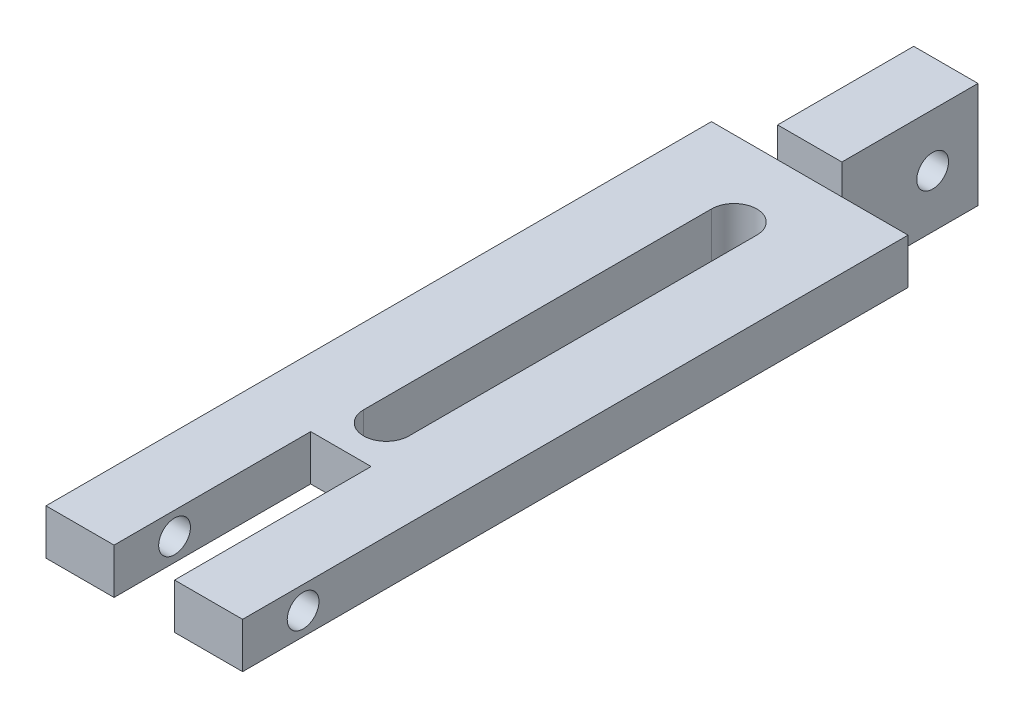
ISO-10303-21;
HEADER;
FILE_DESCRIPTION(('STEP AP214'),'2;1');
FILE_NAME('part.step','',(''),(''),'','','');
FILE_SCHEMA(('AUTOMOTIVE_DESIGN { 1 0 10303 214 1 1 1 1 }'));
ENDSEC;
DATA;
#1=APPLICATION_CONTEXT('core data for automotive mechanical design processes');
#2=APPLICATION_PROTOCOL_DEFINITION('international standard','automotive_design',2000,#1);
#3=PRODUCT_CONTEXT('',#1,'mechanical');
#4=PRODUCT('Part','Part','',(#3));
#5=PRODUCT_RELATED_PRODUCT_CATEGORY('part','',(#4));
#6=PRODUCT_DEFINITION_FORMATION('','',#4);
#7=PRODUCT_DEFINITION_CONTEXT('part definition',#1,'design');
#8=PRODUCT_DEFINITION('design','',#6,#7);
#9=PRODUCT_DEFINITION_SHAPE('','',#8);
#10=(LENGTH_UNIT() NAMED_UNIT(*) SI_UNIT(.MILLI.,.METRE.));
#11=(NAMED_UNIT(*) PLANE_ANGLE_UNIT() SI_UNIT($,.RADIAN.));
#12=(NAMED_UNIT(*) SI_UNIT($,.STERADIAN.) SOLID_ANGLE_UNIT());
#13=UNCERTAINTY_MEASURE_WITH_UNIT(LENGTH_MEASURE(1.E-05),#10,'distance_accuracy_value','');
#14=(GEOMETRIC_REPRESENTATION_CONTEXT(3) GLOBAL_UNCERTAINTY_ASSIGNED_CONTEXT((#13)) GLOBAL_UNIT_ASSIGNED_CONTEXT((#10,
#11,#12)) REPRESENTATION_CONTEXT('',''));
#15=CARTESIAN_POINT('',(0.,0.,0.));
#16=DIRECTION('',(0.,0.,1.));
#17=DIRECTION('',(1.,0.,0.));
#18=AXIS2_PLACEMENT_3D('',#15,#16,#17);
#19=CARTESIAN_POINT('',(0.,3.,0.));
#20=DIRECTION('',(0.,-1.,0.));
#21=DIRECTION('',(0.,0.,-1.));
#22=AXIS2_PLACEMENT_3D('',#19,#20,#21);
#23=PLANE('',#22);
#24=DIRECTION('',(-1.,0.,0.));
#25=VECTOR('',#24,1.);
#26=CARTESIAN_POINT('',(4.25,3.,12.));
#27=LINE('',#26,#25);
#28=CARTESIAN_POINT('',(13.,3.,12.));
#29=VERTEX_POINT('',#28);
#30=CARTESIAN_POINT('',(4.25,3.,12.));
#31=VERTEX_POINT('',#30);
#32=EDGE_CURVE('E251',#29,#31,#27,.T.);
#33=ORIENTED_EDGE('',*,*,#32,.T.);
#34=DIRECTION('',(-1.,0.,0.));
#35=VECTOR('',#34,1.);
#36=CARTESIAN_POINT('',(0.,3.,12.));
#37=LINE('',#36,#35);
#38=CARTESIAN_POINT('',(-4.25,3.,12.));
#39=VERTEX_POINT('',#38);
#40=EDGE_CURVE('E301',#31,#39,#37,.T.);
#41=ORIENTED_EDGE('',*,*,#40,.T.);
#42=DIRECTION('',(-1.,0.,0.));
#43=VECTOR('',#42,1.);
#44=CARTESIAN_POINT('',(-13.,3.,12.));
#45=LINE('',#44,#43);
#46=CARTESIAN_POINT('',(-13.,3.,12.));
#47=VERTEX_POINT('',#46);
#48=EDGE_CURVE('E246',#39,#47,#45,.T.);
#49=ORIENTED_EDGE('',*,*,#48,.T.);
#50=DIRECTION('',(0.,0.,1.));
#51=VECTOR('',#50,1.);
#52=CARTESIAN_POINT('',(-13.,3.,100.));
#53=LINE('',#52,#51);
#54=CARTESIAN_POINT('',(-13.,3.,100.));
#55=VERTEX_POINT('',#54);
#56=EDGE_CURVE('E276',#47,#55,#53,.T.);
#57=ORIENTED_EDGE('',*,*,#56,.T.);
#58=DIRECTION('',(1.,0.,0.));
#59=VECTOR('',#58,1.);
#60=CARTESIAN_POINT('',(-4.,3.,100.));
#61=LINE('',#60,#59);
#62=CARTESIAN_POINT('',(-4.,3.,100.));
#63=VERTEX_POINT('',#62);
#64=EDGE_CURVE('E279',#55,#63,#61,.T.);
#65=ORIENTED_EDGE('',*,*,#64,.T.);
#66=DIRECTION('',(0.,0.,-1.));
#67=VECTOR('',#66,1.);
#68=CARTESIAN_POINT('',(-4.,3.,74.));
#69=LINE('',#68,#67);
#70=CARTESIAN_POINT('',(-4.,3.,74.));
#71=VERTEX_POINT('',#70);
#72=EDGE_CURVE('E282',#63,#71,#69,.T.);
#73=ORIENTED_EDGE('',*,*,#72,.T.);
#74=DIRECTION('',(1.,0.,0.));
#75=VECTOR('',#74,1.);
#76=CARTESIAN_POINT('',(4.,3.,74.));
#77=LINE('',#76,#75);
#78=CARTESIAN_POINT('',(4.,3.,74.));
#79=VERTEX_POINT('',#78);
#80=EDGE_CURVE('E285',#71,#79,#77,.T.);
#81=ORIENTED_EDGE('',*,*,#80,.T.);
#82=DIRECTION('',(0.,0.,1.));
#83=VECTOR('',#82,1.);
#84=CARTESIAN_POINT('',(4.,3.,100.));
#85=LINE('',#84,#83);
#86=CARTESIAN_POINT('',(4.,3.,100.));
#87=VERTEX_POINT('',#86);
#88=EDGE_CURVE('E288',#79,#87,#85,.T.);
#89=ORIENTED_EDGE('',*,*,#88,.T.);
#90=DIRECTION('',(1.,0.,0.));
#91=VECTOR('',#90,1.);
#92=CARTESIAN_POINT('',(13.,3.,100.));
#93=LINE('',#92,#91);
#94=CARTESIAN_POINT('',(13.,3.,100.));
#95=VERTEX_POINT('',#94);
#96=EDGE_CURVE('E291',#87,#95,#93,.T.);
#97=ORIENTED_EDGE('',*,*,#96,.T.);
#98=DIRECTION('',(0.,0.,-1.));
#99=VECTOR('',#98,1.);
#100=CARTESIAN_POINT('',(13.,3.,12.));
#101=LINE('',#100,#99);
#102=EDGE_CURVE('E294',#95,#29,#101,.T.);
#103=ORIENTED_EDGE('',*,*,#102,.T.);
#104=EDGE_LOOP('',(#33,#41,#49,#57,#65,#73,#81,#89,#97,#103));
#105=FACE_BOUND('',#104,.T.);
#106=CARTESIAN_POINT('',(0.,3.,22.));
#107=DIRECTION('',(0.,-1.,0.));
#108=DIRECTION('',(0.,0.,-1.));
#109=AXIS2_PLACEMENT_3D('',#106,#107,#108);
#110=CIRCLE('',#109,3.);
#111=CARTESIAN_POINT('',(3.,3.,22.));
#112=VERTEX_POINT('',#111);
#113=CARTESIAN_POINT('',(-3.,3.,22.));
#114=VERTEX_POINT('',#113);
#115=EDGE_CURVE('E172',#112,#114,#110,.F.);
#116=ORIENTED_EDGE('',*,*,#115,.F.);
#117=DIRECTION('',(0.,0.,-1.));
#118=VECTOR('',#117,1.);
#119=CARTESIAN_POINT('',(3.,3.,0.));
#120=LINE('',#119,#118);
#121=CARTESIAN_POINT('',(3.,3.,68.));
#122=VERTEX_POINT('',#121);
#123=EDGE_CURVE('E329',#122,#112,#120,.T.);
#124=ORIENTED_EDGE('',*,*,#123,.F.);
#125=CARTESIAN_POINT('',(0.,3.,68.));
#126=DIRECTION('',(0.,-1.,0.));
#127=DIRECTION('',(0.,0.,-1.));
#128=AXIS2_PLACEMENT_3D('',#125,#126,#127);
#129=CIRCLE('',#128,3.);
#130=CARTESIAN_POINT('',(-3.,3.,68.));
#131=VERTEX_POINT('',#130);
#132=EDGE_CURVE('E331',#131,#122,#129,.F.);
#133=ORIENTED_EDGE('',*,*,#132,.F.);
#134=DIRECTION('',(0.,0.,1.));
#135=VECTOR('',#134,1.);
#136=CARTESIAN_POINT('',(-3.,3.,0.));
#137=LINE('',#136,#135);
#138=EDGE_CURVE('E333',#114,#131,#137,.T.);
#139=ORIENTED_EDGE('',*,*,#138,.F.);
#140=EDGE_LOOP('',(#116,#124,#133,#139));
#141=FACE_BOUND('',#140,.T.);
#142=ADVANCED_FACE('F39',(#105,#141),#23,.F.);
#143=CARTESIAN_POINT('',(-4.25,-3.,12.));
#144=DIRECTION('',(-1.,0.,0.));
#145=DIRECTION('',(0.,0.,1.));
#146=AXIS2_PLACEMENT_3D('',#143,#144,#145);
#147=PLANE('',#146);
#148=CARTESIAN_POINT('',(-4.25,0.,0.));
#149=DIRECTION('',(-1.,0.,0.));
#150=DIRECTION('',(0.,0.,1.));
#151=AXIS2_PLACEMENT_3D('',#148,#149,#150);
#152=CIRCLE('',#151,2.1);
#153=CARTESIAN_POINT('',(-4.25,0.,2.1));
#154=VERTEX_POINT('',#153);
#155=EDGE_CURVE('E191',#154,#154,#152,.T.);
#156=ORIENTED_EDGE('',*,*,#155,.F.);
#157=EDGE_LOOP('',(#156));
#158=FACE_BOUND('',#157,.T.);
#159=DIRECTION('',(0.,1.,0.));
#160=VECTOR('',#159,1.);
#161=CARTESIAN_POINT('',(-4.25,-3.,12.));
#162=LINE('',#161,#160);
#163=CARTESIAN_POINT('',(-4.25,-3.,12.));
#164=VERTEX_POINT('',#163);
#165=EDGE_CURVE('E273',#164,#39,#162,.T.);
#166=ORIENTED_EDGE('',*,*,#165,.T.);
#167=DIRECTION('',(0.,1.,0.));
#168=VECTOR('',#167,1.);
#169=CARTESIAN_POINT('',(-4.25,-7.,12.));
#170=LINE('',#169,#168);
#171=CARTESIAN_POINT('',(-4.25,7.,12.));
#172=VERTEX_POINT('',#171);
#173=EDGE_CURVE('E225',#39,#172,#170,.T.);
#174=ORIENTED_EDGE('',*,*,#173,.T.);
#175=DIRECTION('',(0.,0.,1.));
#176=VECTOR('',#175,1.);
#177=CARTESIAN_POINT('',(-4.25,7.,12.));
#178=LINE('',#177,#176);
#179=CARTESIAN_POINT('',(-4.25,7.,-6.));
#180=VERTEX_POINT('',#179);
#181=EDGE_CURVE('E174',#180,#172,#178,.T.);
#182=ORIENTED_EDGE('',*,*,#181,.F.);
#183=DIRECTION('',(0.,1.,0.));
#184=VECTOR('',#183,1.);
#185=CARTESIAN_POINT('',(-4.25,-3.,-6.));
#186=LINE('',#185,#184);
#187=CARTESIAN_POINT('',(-4.25,-7.,-6.));
#188=VERTEX_POINT('',#187);
#189=EDGE_CURVE('E299',#188,#180,#186,.T.);
#190=ORIENTED_EDGE('',*,*,#189,.F.);
#191=DIRECTION('',(0.,0.,1.));
#192=VECTOR('',#191,1.);
#193=CARTESIAN_POINT('',(-4.25,-7.,12.));
#194=LINE('',#193,#192);
#195=CARTESIAN_POINT('',(-4.25,-7.,12.));
#196=VERTEX_POINT('',#195);
#197=EDGE_CURVE('E212',#188,#196,#194,.T.);
#198=ORIENTED_EDGE('',*,*,#197,.T.);
#199=EDGE_CURVE('E241',#196,#164,#170,.T.);
#200=ORIENTED_EDGE('',*,*,#199,.T.);
#201=EDGE_LOOP('',(#166,#174,#182,#190,#198,#200));
#202=FACE_BOUND('',#201,.T.);
#203=ADVANCED_FACE('F41',(#158,#202),#147,.T.);
#204=CARTESIAN_POINT('',(-4.25,-3.,-6.));
#205=DIRECTION('',(0.,0.,-1.));
#206=DIRECTION('',(-1.,0.,0.));
#207=AXIS2_PLACEMENT_3D('',#204,#205,#206);
#208=PLANE('',#207);
#209=ORIENTED_EDGE('',*,*,#189,.T.);
#210=DIRECTION('',(-1.,0.,0.));
#211=VECTOR('',#210,1.);
#212=CARTESIAN_POINT('',(-4.25,7.,-6.));
#213=LINE('',#212,#211);
#214=CARTESIAN_POINT('',(4.25,7.,-6.));
#215=VERTEX_POINT('',#214);
#216=EDGE_CURVE('E216',#215,#180,#213,.T.);
#217=ORIENTED_EDGE('',*,*,#216,.F.);
#218=DIRECTION('',(0.,1.,0.));
#219=VECTOR('',#218,1.);
#220=CARTESIAN_POINT('',(4.25,-3.,-6.));
#221=LINE('',#220,#219);
#222=CARTESIAN_POINT('',(4.25,-7.,-6.));
#223=VERTEX_POINT('',#222);
#224=EDGE_CURVE('E302',#223,#215,#221,.T.);
#225=ORIENTED_EDGE('',*,*,#224,.F.);
#226=DIRECTION('',(-1.,0.,0.));
#227=VECTOR('',#226,1.);
#228=CARTESIAN_POINT('',(-4.25,-7.,-6.));
#229=LINE('',#228,#227);
#230=EDGE_CURVE('E222',#223,#188,#229,.T.);
#231=ORIENTED_EDGE('',*,*,#230,.T.);
#232=EDGE_LOOP('',(#209,#217,#225,#231));
#233=FACE_BOUND('',#232,.T.);
#234=ADVANCED_FACE('F358',(#233),#208,.T.);
#235=CARTESIAN_POINT('',(4.25,-3.,-6.));
#236=DIRECTION('',(1.,0.,0.));
#237=DIRECTION('',(0.,0.,-1.));
#238=AXIS2_PLACEMENT_3D('',#235,#236,#237);
#239=PLANE('',#238);
#240=CARTESIAN_POINT('',(4.25,0.,0.));
#241=DIRECTION('',(1.,0.,0.));
#242=DIRECTION('',(0.,0.,-1.));
#243=AXIS2_PLACEMENT_3D('',#240,#241,#242);
#244=CIRCLE('',#243,2.1);
#245=CARTESIAN_POINT('',(4.25,0.,2.1));
#246=VERTEX_POINT('',#245);
#247=EDGE_CURVE('E188',#246,#246,#244,.F.);
#248=ORIENTED_EDGE('',*,*,#247,.T.);
#249=EDGE_LOOP('',(#248));
#250=FACE_BOUND('',#249,.T.);
#251=ORIENTED_EDGE('',*,*,#224,.T.);
#252=DIRECTION('',(0.,0.,-1.));
#253=VECTOR('',#252,1.);
#254=CARTESIAN_POINT('',(4.25,7.,12.));
#255=LINE('',#254,#253);
#256=CARTESIAN_POINT('',(4.25,7.,12.));
#257=VERTEX_POINT('',#256);
#258=EDGE_CURVE('E231',#257,#215,#255,.T.);
#259=ORIENTED_EDGE('',*,*,#258,.F.);
#260=DIRECTION('',(0.,1.,0.));
#261=VECTOR('',#260,1.);
#262=CARTESIAN_POINT('',(4.25,-7.,12.));
#263=LINE('',#262,#261);
#264=EDGE_CURVE('E240',#31,#257,#263,.T.);
#265=ORIENTED_EDGE('',*,*,#264,.F.);
#266=DIRECTION('',(0.,1.,0.));
#267=VECTOR('',#266,1.);
#268=CARTESIAN_POINT('',(4.25,-3.,12.));
#269=LINE('',#268,#267);
#270=CARTESIAN_POINT('',(4.25,-3.,12.));
#271=VERTEX_POINT('',#270);
#272=EDGE_CURVE('E304',#271,#31,#269,.T.);
#273=ORIENTED_EDGE('',*,*,#272,.F.);
#274=CARTESIAN_POINT('',(4.25,-7.,12.));
#275=VERTEX_POINT('',#274);
#276=EDGE_CURVE('E236',#275,#271,#263,.T.);
#277=ORIENTED_EDGE('',*,*,#276,.F.);
#278=DIRECTION('',(0.,0.,-1.));
#279=VECTOR('',#278,1.);
#280=CARTESIAN_POINT('',(4.25,-7.,12.));
#281=LINE('',#280,#279);
#282=EDGE_CURVE('E219',#275,#223,#281,.T.);
#283=ORIENTED_EDGE('',*,*,#282,.T.);
#284=EDGE_LOOP('',(#251,#259,#265,#273,#277,#283));
#285=FACE_BOUND('',#284,.T.);
#286=ADVANCED_FACE('F365',(#250,#285),#239,.T.);
#287=CARTESIAN_POINT('',(4.25,-3.,12.));
#288=DIRECTION('',(0.,0.,-1.));
#289=DIRECTION('',(-1.,0.,0.));
#290=AXIS2_PLACEMENT_3D('',#287,#288,#289);
#291=PLANE('',#290);
#292=ORIENTED_EDGE('',*,*,#32,.F.);
#293=DIRECTION('',(0.,1.,0.));
#294=VECTOR('',#293,1.);
#295=CARTESIAN_POINT('',(13.,-3.,12.));
#296=LINE('',#295,#294);
#297=CARTESIAN_POINT('',(13.,-3.,12.));
#298=VERTEX_POINT('',#297);
#299=EDGE_CURVE('E307',#298,#29,#296,.T.);
#300=ORIENTED_EDGE('',*,*,#299,.F.);
#301=DIRECTION('',(-1.,0.,0.));
#302=VECTOR('',#301,1.);
#303=CARTESIAN_POINT('',(4.25,-3.,12.));
#304=LINE('',#303,#302);
#305=EDGE_CURVE('E270',#298,#271,#304,.T.);
#306=ORIENTED_EDGE('',*,*,#305,.T.);
#307=ORIENTED_EDGE('',*,*,#272,.T.);
#308=EDGE_LOOP('',(#292,#300,#306,#307));
#309=FACE_BOUND('',#308,.T.);
#310=ADVANCED_FACE('F369',(#309),#291,.T.);
#311=CARTESIAN_POINT('',(13.,-3.,12.));
#312=DIRECTION('',(1.,0.,0.));
#313=DIRECTION('',(0.,0.,-1.));
#314=AXIS2_PLACEMENT_3D('',#311,#312,#313);
#315=PLANE('',#314);
#316=CARTESIAN_POINT('',(13.,0.,92.));
#317=DIRECTION('',(1.,0.,0.));
#318=DIRECTION('',(0.,0.,-1.));
#319=AXIS2_PLACEMENT_3D('',#316,#317,#318);
#320=CIRCLE('',#319,2.1);
#321=CARTESIAN_POINT('',(13.,0.,94.1));
#322=VERTEX_POINT('',#321);
#323=EDGE_CURVE('E196',#322,#322,#320,.T.);
#324=ORIENTED_EDGE('',*,*,#323,.F.);
#325=EDGE_LOOP('',(#324));
#326=FACE_BOUND('',#325,.T.);
#327=ORIENTED_EDGE('',*,*,#102,.F.);
#328=DIRECTION('',(0.,1.,0.));
#329=VECTOR('',#328,1.);
#330=CARTESIAN_POINT('',(13.,-3.,100.));
#331=LINE('',#330,#329);
#332=CARTESIAN_POINT('',(13.,-3.,100.));
#333=VERTEX_POINT('',#332);
#334=EDGE_CURVE('E309',#333,#95,#331,.T.);
#335=ORIENTED_EDGE('',*,*,#334,.F.);
#336=DIRECTION('',(0.,0.,-1.));
#337=VECTOR('',#336,1.);
#338=CARTESIAN_POINT('',(13.,-3.,74.));
#339=LINE('',#338,#337);
#340=EDGE_CURVE('E268',#333,#298,#339,.T.);
#341=ORIENTED_EDGE('',*,*,#340,.T.);
#342=ORIENTED_EDGE('',*,*,#299,.T.);
#343=EDGE_LOOP('',(#327,#335,#341,#342));
#344=FACE_BOUND('',#343,.T.);
#345=ADVANCED_FACE('F373',(#326,#344),#315,.T.);
#346=CARTESIAN_POINT('',(13.,-3.,100.));
#347=DIRECTION('',(0.,0.,1.));
#348=DIRECTION('',(1.,0.,0.));
#349=AXIS2_PLACEMENT_3D('',#346,#347,#348);
#350=PLANE('',#349);
#351=ORIENTED_EDGE('',*,*,#96,.F.);
#352=DIRECTION('',(0.,1.,0.));
#353=VECTOR('',#352,1.);
#354=CARTESIAN_POINT('',(4.,-3.,100.));
#355=LINE('',#354,#353);
#356=CARTESIAN_POINT('',(4.,-3.,100.));
#357=VERTEX_POINT('',#356);
#358=EDGE_CURVE('E312',#357,#87,#355,.T.);
#359=ORIENTED_EDGE('',*,*,#358,.F.);
#360=DIRECTION('',(1.,0.,0.));
#361=VECTOR('',#360,1.);
#362=CARTESIAN_POINT('',(13.,-3.,100.));
#363=LINE('',#362,#361);
#364=EDGE_CURVE('E265',#357,#333,#363,.T.);
#365=ORIENTED_EDGE('',*,*,#364,.T.);
#366=ORIENTED_EDGE('',*,*,#334,.T.);
#367=EDGE_LOOP('',(#351,#359,#365,#366));
#368=FACE_BOUND('',#367,.T.);
#369=ADVANCED_FACE('F377',(#368),#350,.T.);
#370=CARTESIAN_POINT('',(4.,-3.,100.));
#371=DIRECTION('',(-1.,0.,0.));
#372=DIRECTION('',(0.,0.,1.));
#373=AXIS2_PLACEMENT_3D('',#370,#371,#372);
#374=PLANE('',#373);
#375=CARTESIAN_POINT('',(4.,0.,92.));
#376=DIRECTION('',(-1.,0.,0.));
#377=DIRECTION('',(0.,0.,1.));
#378=AXIS2_PLACEMENT_3D('',#375,#376,#377);
#379=CIRCLE('',#378,2.1);
#380=CARTESIAN_POINT('',(4.,0.,94.1));
#381=VERTEX_POINT('',#380);
#382=EDGE_CURVE('E43',#381,#381,#379,.F.);
#383=ORIENTED_EDGE('',*,*,#382,.T.);
#384=EDGE_LOOP('',(#383));
#385=FACE_BOUND('',#384,.T.);
#386=ORIENTED_EDGE('',*,*,#88,.F.);
#387=DIRECTION('',(0.,1.,0.));
#388=VECTOR('',#387,1.);
#389=CARTESIAN_POINT('',(4.,-3.,74.));
#390=LINE('',#389,#388);
#391=CARTESIAN_POINT('',(4.,-3.,74.));
#392=VERTEX_POINT('',#391);
#393=EDGE_CURVE('E314',#392,#79,#390,.T.);
#394=ORIENTED_EDGE('',*,*,#393,.F.);
#395=DIRECTION('',(0.,0.,1.));
#396=VECTOR('',#395,1.);
#397=CARTESIAN_POINT('',(4.,-3.,100.));
#398=LINE('',#397,#396);
#399=EDGE_CURVE('E262',#392,#357,#398,.T.);
#400=ORIENTED_EDGE('',*,*,#399,.T.);
#401=ORIENTED_EDGE('',*,*,#358,.T.);
#402=EDGE_LOOP('',(#386,#394,#400,#401));
#403=FACE_BOUND('',#402,.T.);
#404=ADVANCED_FACE('F381',(#385,#403),#374,.T.);
#405=CARTESIAN_POINT('',(4.,-3.,74.));
#406=DIRECTION('',(0.,0.,1.));
#407=DIRECTION('',(1.,0.,0.));
#408=AXIS2_PLACEMENT_3D('',#405,#406,#407);
#409=PLANE('',#408);
#410=ORIENTED_EDGE('',*,*,#80,.F.);
#411=DIRECTION('',(0.,1.,0.));
#412=VECTOR('',#411,1.);
#413=CARTESIAN_POINT('',(-4.,-3.,74.));
#414=LINE('',#413,#412);
#415=CARTESIAN_POINT('',(-4.,-3.,74.));
#416=VERTEX_POINT('',#415);
#417=EDGE_CURVE('E316',#416,#71,#414,.T.);
#418=ORIENTED_EDGE('',*,*,#417,.F.);
#419=DIRECTION('',(1.,0.,0.));
#420=VECTOR('',#419,1.);
#421=CARTESIAN_POINT('',(4.,-3.,74.));
#422=LINE('',#421,#420);
#423=EDGE_CURVE('E259',#416,#392,#422,.T.);
#424=ORIENTED_EDGE('',*,*,#423,.T.);
#425=ORIENTED_EDGE('',*,*,#393,.T.);
#426=EDGE_LOOP('',(#410,#418,#424,#425));
#427=FACE_BOUND('',#426,.T.);
#428=ADVANCED_FACE('F385',(#427),#409,.T.);
#429=CARTESIAN_POINT('',(-4.,-3.,74.));
#430=DIRECTION('',(1.,0.,0.));
#431=DIRECTION('',(0.,0.,-1.));
#432=AXIS2_PLACEMENT_3D('',#429,#430,#431);
#433=PLANE('',#432);
#434=CARTESIAN_POINT('',(-4.,0.,92.));
#435=DIRECTION('',(1.,0.,0.));
#436=DIRECTION('',(0.,0.,-1.));
#437=AXIS2_PLACEMENT_3D('',#434,#435,#436);
#438=CIRCLE('',#437,2.1);
#439=CARTESIAN_POINT('',(-4.,0.,89.9));
#440=VERTEX_POINT('',#439);
#441=EDGE_CURVE('E200',#440,#440,#438,.T.);
#442=ORIENTED_EDGE('',*,*,#441,.F.);
#443=EDGE_LOOP('',(#442));
#444=FACE_BOUND('',#443,.T.);
#445=ORIENTED_EDGE('',*,*,#72,.F.);
#446=DIRECTION('',(0.,1.,0.));
#447=VECTOR('',#446,1.);
#448=CARTESIAN_POINT('',(-4.,-3.,100.));
#449=LINE('',#448,#447);
#450=CARTESIAN_POINT('',(-4.,-3.,100.));
#451=VERTEX_POINT('',#450);
#452=EDGE_CURVE('E318',#451,#63,#449,.T.);
#453=ORIENTED_EDGE('',*,*,#452,.F.);
#454=DIRECTION('',(0.,0.,-1.));
#455=VECTOR('',#454,1.);
#456=CARTESIAN_POINT('',(-4.,-3.,74.));
#457=LINE('',#456,#455);
#458=EDGE_CURVE('E256',#451,#416,#457,.T.);
#459=ORIENTED_EDGE('',*,*,#458,.T.);
#460=ORIENTED_EDGE('',*,*,#417,.T.);
#461=EDGE_LOOP('',(#445,#453,#459,#460));
#462=FACE_BOUND('',#461,.T.);
#463=ADVANCED_FACE('F388',(#444,#462),#433,.T.);
#464=CARTESIAN_POINT('',(-4.,-3.,100.));
#465=DIRECTION('',(0.,0.,1.));
#466=DIRECTION('',(1.,0.,0.));
#467=AXIS2_PLACEMENT_3D('',#464,#465,#466);
#468=PLANE('',#467);
#469=ORIENTED_EDGE('',*,*,#64,.F.);
#470=DIRECTION('',(0.,1.,0.));
#471=VECTOR('',#470,1.);
#472=CARTESIAN_POINT('',(-13.,-3.,100.));
#473=LINE('',#472,#471);
#474=CARTESIAN_POINT('',(-13.,-3.,100.));
#475=VERTEX_POINT('',#474);
#476=EDGE_CURVE('E320',#475,#55,#473,.T.);
#477=ORIENTED_EDGE('',*,*,#476,.F.);
#478=DIRECTION('',(1.,0.,0.));
#479=VECTOR('',#478,1.);
#480=CARTESIAN_POINT('',(-4.,-3.,100.));
#481=LINE('',#480,#479);
#482=EDGE_CURVE('E253',#475,#451,#481,.T.);
#483=ORIENTED_EDGE('',*,*,#482,.T.);
#484=ORIENTED_EDGE('',*,*,#452,.T.);
#485=EDGE_LOOP('',(#469,#477,#483,#484));
#486=FACE_BOUND('',#485,.T.);
#487=ADVANCED_FACE('F392',(#486),#468,.T.);
#488=CARTESIAN_POINT('',(-13.,-3.,100.));
#489=DIRECTION('',(-1.,0.,0.));
#490=DIRECTION('',(0.,0.,1.));
#491=AXIS2_PLACEMENT_3D('',#488,#489,#490);
#492=PLANE('',#491);
#493=CARTESIAN_POINT('',(-13.,0.,92.));
#494=DIRECTION('',(1.,0.,0.));
#495=DIRECTION('',(0.,0.,-1.));
#496=AXIS2_PLACEMENT_3D('',#493,#494,#495);
#497=CIRCLE('',#496,2.1);
#498=CARTESIAN_POINT('',(-13.,0.,89.9));
#499=VERTEX_POINT('',#498);
#500=EDGE_CURVE('E205',#499,#499,#497,.T.);
#501=ORIENTED_EDGE('',*,*,#500,.T.);
#502=EDGE_LOOP('',(#501));
#503=FACE_BOUND('',#502,.T.);
#504=ORIENTED_EDGE('',*,*,#56,.F.);
#505=DIRECTION('',(0.,1.,0.));
#506=VECTOR('',#505,1.);
#507=CARTESIAN_POINT('',(-13.,-3.,12.));
#508=LINE('',#507,#506);
#509=CARTESIAN_POINT('',(-13.,-3.,12.));
#510=VERTEX_POINT('',#509);
#511=EDGE_CURVE('E322',#510,#47,#508,.T.);
#512=ORIENTED_EDGE('',*,*,#511,.F.);
#513=DIRECTION('',(0.,0.,1.));
#514=VECTOR('',#513,1.);
#515=CARTESIAN_POINT('',(-13.,-3.,74.));
#516=LINE('',#515,#514);
#517=EDGE_CURVE('E250',#510,#475,#516,.T.);
#518=ORIENTED_EDGE('',*,*,#517,.T.);
#519=ORIENTED_EDGE('',*,*,#476,.T.);
#520=EDGE_LOOP('',(#504,#512,#518,#519));
#521=FACE_BOUND('',#520,.T.);
#522=ADVANCED_FACE('F396',(#503,#521),#492,.T.);
#523=CARTESIAN_POINT('',(-13.,-3.,12.));
#524=DIRECTION('',(0.,0.,-1.));
#525=DIRECTION('',(-1.,0.,0.));
#526=AXIS2_PLACEMENT_3D('',#523,#524,#525);
#527=PLANE('',#526);
#528=ORIENTED_EDGE('',*,*,#48,.F.);
#529=ORIENTED_EDGE('',*,*,#165,.F.);
#530=DIRECTION('',(-1.,0.,0.));
#531=VECTOR('',#530,1.);
#532=CARTESIAN_POINT('',(-13.,-3.,12.));
#533=LINE('',#532,#531);
#534=EDGE_CURVE('E247',#164,#510,#533,.T.);
#535=ORIENTED_EDGE('',*,*,#534,.T.);
#536=ORIENTED_EDGE('',*,*,#511,.T.);
#537=EDGE_LOOP('',(#528,#529,#535,#536));
#538=FACE_BOUND('',#537,.T.);
#539=ADVANCED_FACE('F399',(#538),#527,.T.);
#540=CARTESIAN_POINT('',(0.,-3.,0.));
#541=DIRECTION('',(0.,-1.,0.));
#542=DIRECTION('',(0.,0.,-1.));
#543=AXIS2_PLACEMENT_3D('',#540,#541,#542);
#544=PLANE('',#543);
#545=CARTESIAN_POINT('',(0.,-3.,22.));
#546=DIRECTION('',(0.,-1.,0.));
#547=DIRECTION('',(0.,0.,-1.));
#548=AXIS2_PLACEMENT_3D('',#545,#546,#547);
#549=CIRCLE('',#548,3.);
#550=CARTESIAN_POINT('',(-3.,-3.,22.));
#551=VERTEX_POINT('',#550);
#552=CARTESIAN_POINT('',(3.,-3.,22.));
#553=VERTEX_POINT('',#552);
#554=EDGE_CURVE('E11',#551,#553,#549,.T.);
#555=ORIENTED_EDGE('',*,*,#554,.F.);
#556=DIRECTION('',(0.,0.,-1.));
#557=VECTOR('',#556,1.);
#558=CARTESIAN_POINT('',(-3.,-3.,0.));
#559=LINE('',#558,#557);
#560=CARTESIAN_POINT('',(-3.,-3.,68.));
#561=VERTEX_POINT('',#560);
#562=EDGE_CURVE('E177',#561,#551,#559,.T.);
#563=ORIENTED_EDGE('',*,*,#562,.F.);
#564=CARTESIAN_POINT('',(0.,-3.,68.));
#565=DIRECTION('',(0.,-1.,0.));
#566=DIRECTION('',(0.,0.,-1.));
#567=AXIS2_PLACEMENT_3D('',#564,#565,#566);
#568=CIRCLE('',#567,3.);
#569=CARTESIAN_POINT('',(3.,-3.,68.));
#570=VERTEX_POINT('',#569);
#571=EDGE_CURVE('E181',#570,#561,#568,.T.);
#572=ORIENTED_EDGE('',*,*,#571,.F.);
#573=DIRECTION('',(0.,0.,1.));
#574=VECTOR('',#573,1.);
#575=CARTESIAN_POINT('',(3.,-3.,0.));
#576=LINE('',#575,#574);
#577=EDGE_CURVE('E48',#553,#570,#576,.T.);
#578=ORIENTED_EDGE('',*,*,#577,.F.);
#579=EDGE_LOOP('',(#555,#563,#572,#578));
#580=FACE_BOUND('',#579,.T.);
#581=DIRECTION('',(-1.,0.,0.));
#582=VECTOR('',#581,1.);
#583=CARTESIAN_POINT('',(0.,-3.,12.));
#584=LINE('',#583,#582);
#585=EDGE_CURVE('E239',#271,#164,#584,.T.);
#586=ORIENTED_EDGE('',*,*,#585,.F.);
#587=ORIENTED_EDGE('',*,*,#305,.F.);
#588=ORIENTED_EDGE('',*,*,#340,.F.);
#589=ORIENTED_EDGE('',*,*,#364,.F.);
#590=ORIENTED_EDGE('',*,*,#399,.F.);
#591=ORIENTED_EDGE('',*,*,#423,.F.);
#592=ORIENTED_EDGE('',*,*,#458,.F.);
#593=ORIENTED_EDGE('',*,*,#482,.F.);
#594=ORIENTED_EDGE('',*,*,#517,.F.);
#595=ORIENTED_EDGE('',*,*,#534,.F.);
#596=EDGE_LOOP('',(#586,#587,#588,#589,#590,#591,#592,#593,#594,#595));
#597=FACE_BOUND('',#596,.T.);
#598=ADVANCED_FACE('F183',(#580,#597),#544,.T.);
#599=CARTESIAN_POINT('',(0.,7.,0.));
#600=DIRECTION('',(0.,-1.,0.));
#601=DIRECTION('',(0.,0.,-1.));
#602=AXIS2_PLACEMENT_3D('',#599,#600,#601);
#603=PLANE('',#602);
#604=ORIENTED_EDGE('',*,*,#181,.T.);
#605=DIRECTION('',(1.,0.,0.));
#606=VECTOR('',#605,1.);
#607=CARTESIAN_POINT('',(-4.25,7.,12.));
#608=LINE('',#607,#606);
#609=EDGE_CURVE('E228',#172,#257,#608,.T.);
#610=ORIENTED_EDGE('',*,*,#609,.T.);
#611=ORIENTED_EDGE('',*,*,#258,.T.);
#612=ORIENTED_EDGE('',*,*,#216,.T.);
#613=EDGE_LOOP('',(#604,#610,#611,#612));
#614=FACE_BOUND('',#613,.T.);
#615=ADVANCED_FACE('F406',(#614),#603,.F.);
#616=CARTESIAN_POINT('',(-4.25,-7.,12.));
#617=DIRECTION('',(0.,0.,1.));
#618=DIRECTION('',(1.,0.,0.));
#619=AXIS2_PLACEMENT_3D('',#616,#617,#618);
#620=PLANE('',#619);
#621=ORIENTED_EDGE('',*,*,#40,.F.);
#622=ORIENTED_EDGE('',*,*,#264,.T.);
#623=ORIENTED_EDGE('',*,*,#609,.F.);
#624=ORIENTED_EDGE('',*,*,#173,.F.);
#625=EDGE_LOOP('',(#621,#622,#623,#624));
#626=FACE_BOUND('',#625,.T.);
#627=ADVANCED_FACE('F445',(#626),#620,.T.);
#628=ORIENTED_EDGE('',*,*,#276,.T.);
#629=ORIENTED_EDGE('',*,*,#585,.T.);
#630=ORIENTED_EDGE('',*,*,#199,.F.);
#631=DIRECTION('',(1.,0.,0.));
#632=VECTOR('',#631,1.);
#633=CARTESIAN_POINT('',(-4.25,-7.,12.));
#634=LINE('',#633,#632);
#635=EDGE_CURVE('E215',#196,#275,#634,.T.);
#636=ORIENTED_EDGE('',*,*,#635,.T.);
#637=EDGE_LOOP('',(#628,#629,#630,#636));
#638=FACE_BOUND('',#637,.T.);
#639=ADVANCED_FACE('F418',(#638),#620,.T.);
#640=CARTESIAN_POINT('',(0.,-7.,0.));
#641=DIRECTION('',(0.,-1.,0.));
#642=DIRECTION('',(0.,0.,-1.));
#643=AXIS2_PLACEMENT_3D('',#640,#641,#642);
#644=PLANE('',#643);
#645=ORIENTED_EDGE('',*,*,#197,.F.);
#646=ORIENTED_EDGE('',*,*,#230,.F.);
#647=ORIENTED_EDGE('',*,*,#282,.F.);
#648=ORIENTED_EDGE('',*,*,#635,.F.);
#649=EDGE_LOOP('',(#645,#646,#647,#648));
#650=FACE_BOUND('',#649,.T.);
#651=ADVANCED_FACE('F421',(#650),#644,.T.);
#652=CARTESIAN_POINT('',(0.,7.,22.));
#653=DIRECTION('',(0.,-1.,0.));
#654=DIRECTION('',(0.,0.,-1.));
#655=AXIS2_PLACEMENT_3D('',#652,#653,#654);
#656=CYLINDRICAL_SURFACE('',#655,3.);
#657=ORIENTED_EDGE('',*,*,#115,.T.);
#658=DIRECTION('',(0.,-1.,0.));
#659=VECTOR('',#658,1.);
#660=CARTESIAN_POINT('',(-3.,7.,22.));
#661=LINE('',#660,#659);
#662=EDGE_CURVE('E166',#114,#551,#661,.T.);
#663=ORIENTED_EDGE('',*,*,#662,.T.);
#664=ORIENTED_EDGE('',*,*,#554,.T.);
#665=DIRECTION('',(0.,-1.,0.));
#666=VECTOR('',#665,1.);
#667=CARTESIAN_POINT('',(3.,7.,22.));
#668=LINE('',#667,#666);
#669=EDGE_CURVE('E190',#112,#553,#668,.T.);
#670=ORIENTED_EDGE('',*,*,#669,.F.);
#671=EDGE_LOOP('',(#657,#663,#664,#670));
#672=FACE_BOUND('',#671,.T.);
#673=ADVANCED_FACE('F167',(#672),#656,.F.);
#674=CARTESIAN_POINT('',(-3.,7.,22.));
#675=DIRECTION('',(1.,0.,0.));
#676=DIRECTION('',(0.,0.,-1.));
#677=AXIS2_PLACEMENT_3D('',#674,#675,#676);
#678=PLANE('',#677);
#679=ORIENTED_EDGE('',*,*,#138,.T.);
#680=DIRECTION('',(0.,-1.,0.));
#681=VECTOR('',#680,1.);
#682=CARTESIAN_POINT('',(-3.,7.,68.));
#683=LINE('',#682,#681);
#684=EDGE_CURVE('E56',#131,#561,#683,.T.);
#685=ORIENTED_EDGE('',*,*,#684,.T.);
#686=ORIENTED_EDGE('',*,*,#562,.T.);
#687=ORIENTED_EDGE('',*,*,#662,.F.);
#688=EDGE_LOOP('',(#679,#685,#686,#687));
#689=FACE_BOUND('',#688,.T.);
#690=ADVANCED_FACE('F178',(#689),#678,.T.);
#691=CARTESIAN_POINT('',(0.,7.,68.));
#692=DIRECTION('',(0.,-1.,0.));
#693=DIRECTION('',(0.,0.,-1.));
#694=AXIS2_PLACEMENT_3D('',#691,#692,#693);
#695=CYLINDRICAL_SURFACE('',#694,3.);
#696=ORIENTED_EDGE('',*,*,#132,.T.);
#697=DIRECTION('',(0.,-1.,0.));
#698=VECTOR('',#697,1.);
#699=CARTESIAN_POINT('',(3.,7.,68.));
#700=LINE('',#699,#698);
#701=EDGE_CURVE('E64',#122,#570,#700,.T.);
#702=ORIENTED_EDGE('',*,*,#701,.T.);
#703=ORIENTED_EDGE('',*,*,#571,.T.);
#704=ORIENTED_EDGE('',*,*,#684,.F.);
#705=EDGE_LOOP('',(#696,#702,#703,#704));
#706=FACE_BOUND('',#705,.T.);
#707=ADVANCED_FACE('F338',(#706),#695,.F.);
#708=CARTESIAN_POINT('',(3.,7.,22.));
#709=DIRECTION('',(-1.,0.,0.));
#710=DIRECTION('',(0.,0.,1.));
#711=AXIS2_PLACEMENT_3D('',#708,#709,#710);
#712=PLANE('',#711);
#713=ORIENTED_EDGE('',*,*,#123,.T.);
#714=ORIENTED_EDGE('',*,*,#669,.T.);
#715=ORIENTED_EDGE('',*,*,#577,.T.);
#716=ORIENTED_EDGE('',*,*,#701,.F.);
#717=EDGE_LOOP('',(#713,#714,#715,#716));
#718=FACE_BOUND('',#717,.T.);
#719=ADVANCED_FACE('F340',(#718),#712,.T.);
#720=CARTESIAN_POINT('',(13.,0.,0.));
#721=DIRECTION('',(-1.,0.,0.));
#722=DIRECTION('',(0.,0.,1.));
#723=AXIS2_PLACEMENT_3D('',#720,#721,#722);
#724=CYLINDRICAL_SURFACE('',#723,2.1);
#725=CARTESIAN_POINT('',(4.25,0.,2.1));
#726=CARTESIAN_POINT('',(4.16145833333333,0.,2.1));
#727=CARTESIAN_POINT('',(4.07291666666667,0.,2.1));
#728=CARTESIAN_POINT('',(3.89583333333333,0.,2.1));
#729=CARTESIAN_POINT('',(3.80729166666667,0.,2.1));
#730=CARTESIAN_POINT('',(3.63020833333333,0.,2.1));
#731=CARTESIAN_POINT('',(3.54166666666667,0.,2.1));
#732=CARTESIAN_POINT('',(3.36458333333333,0.,2.1));
#733=CARTESIAN_POINT('',(3.27604166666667,0.,2.1));
#734=CARTESIAN_POINT('',(3.09895833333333,0.,2.1));
#735=CARTESIAN_POINT('',(3.01041666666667,0.,2.1));
#736=CARTESIAN_POINT('',(2.83333333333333,0.,2.1));
#737=CARTESIAN_POINT('',(2.74479166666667,0.,2.1));
#738=CARTESIAN_POINT('',(2.56770833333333,0.,2.1));
#739=CARTESIAN_POINT('',(2.47916666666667,0.,2.1));
#740=CARTESIAN_POINT('',(2.30208333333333,0.,2.1));
#741=CARTESIAN_POINT('',(2.21354166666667,0.,2.1));
#742=CARTESIAN_POINT('',(2.03645833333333,0.,2.1));
#743=CARTESIAN_POINT('',(1.94791666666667,0.,2.1));
#744=CARTESIAN_POINT('',(1.77083333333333,0.,2.1));
#745=CARTESIAN_POINT('',(1.68229166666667,0.,2.1));
#746=CARTESIAN_POINT('',(1.50520833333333,0.,2.1));
#747=CARTESIAN_POINT('',(1.41666666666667,0.,2.1));
#748=CARTESIAN_POINT('',(1.23958333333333,0.,2.1));
#749=CARTESIAN_POINT('',(1.15104166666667,0.,2.1));
#750=CARTESIAN_POINT('',(0.973958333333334,0.,2.1));
#751=CARTESIAN_POINT('',(0.885416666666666,0.,2.1));
#752=CARTESIAN_POINT('',(0.708333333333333,0.,2.1));
#753=CARTESIAN_POINT('',(0.619791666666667,0.,2.1));
#754=CARTESIAN_POINT('',(0.442708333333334,0.,2.1));
#755=CARTESIAN_POINT('',(0.354166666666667,0.,2.1));
#756=CARTESIAN_POINT('',(0.177083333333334,0.,2.1));
#757=CARTESIAN_POINT('',(0.0885416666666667,0.,2.1));
#758=CARTESIAN_POINT('',(-0.0885416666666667,0.,2.1));
#759=CARTESIAN_POINT('',(-0.177083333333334,0.,2.1));
#760=CARTESIAN_POINT('',(-0.354166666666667,0.,2.1));
#761=CARTESIAN_POINT('',(-0.442708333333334,0.,2.1));
#762=CARTESIAN_POINT('',(-0.619791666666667,0.,2.1));
#763=CARTESIAN_POINT('',(-0.708333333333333,0.,2.1));
#764=CARTESIAN_POINT('',(-0.885416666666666,0.,2.1));
#765=CARTESIAN_POINT('',(-0.973958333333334,0.,2.1));
#766=CARTESIAN_POINT('',(-1.15104166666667,0.,2.1));
#767=CARTESIAN_POINT('',(-1.23958333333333,0.,2.1));
#768=CARTESIAN_POINT('',(-1.41666666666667,0.,2.1));
#769=CARTESIAN_POINT('',(-1.50520833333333,0.,2.1));
#770=CARTESIAN_POINT('',(-1.68229166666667,0.,2.1));
#771=CARTESIAN_POINT('',(-1.77083333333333,0.,2.1));
#772=CARTESIAN_POINT('',(-1.94791666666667,0.,2.1));
#773=CARTESIAN_POINT('',(-2.03645833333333,0.,2.1));
#774=CARTESIAN_POINT('',(-2.21354166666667,0.,2.1));
#775=CARTESIAN_POINT('',(-2.30208333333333,0.,2.1));
#776=CARTESIAN_POINT('',(-2.47916666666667,0.,2.1));
#777=CARTESIAN_POINT('',(-2.56770833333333,0.,2.1));
#778=CARTESIAN_POINT('',(-2.74479166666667,0.,2.1));
#779=CARTESIAN_POINT('',(-2.83333333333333,0.,2.1));
#780=CARTESIAN_POINT('',(-3.01041666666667,0.,2.1));
#781=CARTESIAN_POINT('',(-3.09895833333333,0.,2.1));
#782=CARTESIAN_POINT('',(-3.27604166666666,0.,2.1));
#783=CARTESIAN_POINT('',(-3.36458333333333,0.,2.1));
#784=CARTESIAN_POINT('',(-3.54166666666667,0.,2.1));
#785=CARTESIAN_POINT('',(-3.63020833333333,0.,2.1));
#786=CARTESIAN_POINT('',(-3.80729166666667,0.,2.1));
#787=CARTESIAN_POINT('',(-3.89583333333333,0.,2.1));
#788=CARTESIAN_POINT('',(-4.07291666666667,0.,2.1));
#789=CARTESIAN_POINT('',(-4.16145833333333,0.,2.1));
#790=CARTESIAN_POINT('',(-4.25,0.,2.1));
#791=B_SPLINE_CURVE_WITH_KNOTS('',3,(#725,#726,#727,#728,#729,#730,#731,#732,#733,#734,#735,
#736,#737,#738,#739,#740,#741,#742,#743,#744,#745,#746,#747,#748,#749,#750,#751,#752,#753,#754,
#755,#756,#757,#758,#759,#760,#761,#762,#763,#764,#765,#766,#767,#768,#769,#770,#771,#772,#773,
#774,#775,#776,#777,#778,#779,#780,#781,#782,#783,#784,#785,#786,#787,#788,#789,#790),
.UNSPECIFIED.,.F.,.F.,(4,2,2,2,2,2,2,2,2,2,2,2,2,2,2,2,2,2,2,2,2,2,2,2,2,2,2,2,2,2,2,2,4),(0.,
0.265625,0.53125,0.796875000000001,1.0625,1.328125,1.59375,1.859375,2.125,2.390625,2.65625,
2.921875,3.1875,3.453125,3.71875,3.984375,4.25,4.515625,4.78125,5.046875,5.3125,5.578125,
5.84375,6.109375,6.375,6.640625,6.90625,7.171875,7.4375,7.703125,7.96875,8.234375,8.5),.UNSPECIFIED.);
#792=EDGE_CURVE('BSEAM342',#246,#154,#791,.T.);
#793=ORIENTED_EDGE('',*,*,#247,.F.);
#794=ORIENTED_EDGE('',*,*,#155,.T.);
#795=ORIENTED_EDGE('',*,*,#792,.T.);
#796=ORIENTED_EDGE('',*,*,#792,.F.);
#797=EDGE_LOOP('',(#793,#795,#794,#796));
#798=FACE_BOUND('',#797,.T.);
#799=ADVANCED_FACE('F342',(#798),#724,.F.);
#800=CARTESIAN_POINT('',(13.,0.,92.));
#801=DIRECTION('',(-1.,0.,0.));
#802=DIRECTION('',(0.,0.,1.));
#803=AXIS2_PLACEMENT_3D('',#800,#801,#802);
#804=CYLINDRICAL_SURFACE('',#803,2.1);
#805=CARTESIAN_POINT('',(4.,0.,94.1));
#806=CARTESIAN_POINT('',(4.09375,0.,94.1));
#807=CARTESIAN_POINT('',(4.1875,0.,94.1));
#808=CARTESIAN_POINT('',(4.375,0.,94.1));
#809=CARTESIAN_POINT('',(4.46875,0.,94.1));
#810=CARTESIAN_POINT('',(4.65625,0.,94.1));
#811=CARTESIAN_POINT('',(4.75,0.,94.1));
#812=CARTESIAN_POINT('',(4.9375,0.,94.1));
#813=CARTESIAN_POINT('',(5.03125,0.,94.1));
#814=CARTESIAN_POINT('',(5.21875,0.,94.1));
#815=CARTESIAN_POINT('',(5.3125,0.,94.1));
#816=CARTESIAN_POINT('',(5.5,0.,94.1));
#817=CARTESIAN_POINT('',(5.59375,0.,94.1));
#818=CARTESIAN_POINT('',(5.78125,0.,94.1));
#819=CARTESIAN_POINT('',(5.875,0.,94.1));
#820=CARTESIAN_POINT('',(6.0625,0.,94.1));
#821=CARTESIAN_POINT('',(6.15625,0.,94.1));
#822=CARTESIAN_POINT('',(6.34375,0.,94.1));
#823=CARTESIAN_POINT('',(6.4375,0.,94.1));
#824=CARTESIAN_POINT('',(6.625,0.,94.1));
#825=CARTESIAN_POINT('',(6.71875,0.,94.1));
#826=CARTESIAN_POINT('',(6.90625,0.,94.1));
#827=CARTESIAN_POINT('',(7.,0.,94.1));
#828=CARTESIAN_POINT('',(7.1875,0.,94.1));
#829=CARTESIAN_POINT('',(7.28125,0.,94.1));
#830=CARTESIAN_POINT('',(7.46875,0.,94.1));
#831=CARTESIAN_POINT('',(7.5625,0.,94.1));
#832=CARTESIAN_POINT('',(7.75,0.,94.1));
#833=CARTESIAN_POINT('',(7.84375,0.,94.1));
#834=CARTESIAN_POINT('',(8.03125,0.,94.1));
#835=CARTESIAN_POINT('',(8.125,0.,94.1));
#836=CARTESIAN_POINT('',(8.3125,0.,94.1));
#837=CARTESIAN_POINT('',(8.40625,0.,94.1));
#838=CARTESIAN_POINT('',(8.59375,0.,94.1));
#839=CARTESIAN_POINT('',(8.6875,0.,94.1));
#840=CARTESIAN_POINT('',(8.875,0.,94.1));
#841=CARTESIAN_POINT('',(8.96875,0.,94.1));
#842=CARTESIAN_POINT('',(9.15625,0.,94.1));
#843=CARTESIAN_POINT('',(9.25,0.,94.1));
#844=CARTESIAN_POINT('',(9.4375,0.,94.1));
#845=CARTESIAN_POINT('',(9.53125,0.,94.1));
#846=CARTESIAN_POINT('',(9.71875,0.,94.1));
#847=CARTESIAN_POINT('',(9.8125,0.,94.1));
#848=CARTESIAN_POINT('',(10.,0.,94.1));
#849=CARTESIAN_POINT('',(10.09375,0.,94.1));
#850=CARTESIAN_POINT('',(10.28125,0.,94.1));
#851=CARTESIAN_POINT('',(10.375,0.,94.1));
#852=CARTESIAN_POINT('',(10.5625,0.,94.1));
#853=CARTESIAN_POINT('',(10.65625,0.,94.1));
#854=CARTESIAN_POINT('',(10.84375,0.,94.1));
#855=CARTESIAN_POINT('',(10.9375,0.,94.1));
#856=CARTESIAN_POINT('',(11.125,0.,94.1));
#857=CARTESIAN_POINT('',(11.21875,0.,94.1));
#858=CARTESIAN_POINT('',(11.40625,0.,94.1));
#859=CARTESIAN_POINT('',(11.5,0.,94.1));
#860=CARTESIAN_POINT('',(11.6875,0.,94.1));
#861=CARTESIAN_POINT('',(11.78125,0.,94.1));
#862=CARTESIAN_POINT('',(11.96875,0.,94.1));
#863=CARTESIAN_POINT('',(12.0625,0.,94.1));
#864=CARTESIAN_POINT('',(12.25,0.,94.1));
#865=CARTESIAN_POINT('',(12.34375,0.,94.1));
#866=CARTESIAN_POINT('',(12.53125,0.,94.1));
#867=CARTESIAN_POINT('',(12.625,0.,94.1));
#868=CARTESIAN_POINT('',(12.8125,0.,94.1));
#869=CARTESIAN_POINT('',(12.90625,0.,94.1));
#870=CARTESIAN_POINT('',(13.,0.,94.1));
#871=B_SPLINE_CURVE_WITH_KNOTS('',3,(#805,#806,#807,#808,#809,#810,#811,#812,#813,#814,#815,
#816,#817,#818,#819,#820,#821,#822,#823,#824,#825,#826,#827,#828,#829,#830,#831,#832,#833,#834,
#835,#836,#837,#838,#839,#840,#841,#842,#843,#844,#845,#846,#847,#848,#849,#850,#851,#852,#853,
#854,#855,#856,#857,#858,#859,#860,#861,#862,#863,#864,#865,#866,#867,#868,#869,#870),
.UNSPECIFIED.,.F.,.F.,(4,2,2,2,2,2,2,2,2,2,2,2,2,2,2,2,2,2,2,2,2,2,2,2,2,2,2,2,2,2,2,2,4),(0.,
0.28125,0.5625,0.843750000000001,1.125,1.40625,1.6875,1.96875,2.25,2.53125,2.8125,3.09375,3.375,
3.65625,3.9375,4.21875,4.5,4.78125,5.0625,5.34375,5.625,5.90625,6.1875,6.46875,6.75,7.03125,
7.3125,7.59375,7.875,8.15625,8.4375,8.71875,9.),.UNSPECIFIED.);
#872=EDGE_CURVE('BSEAM348',#381,#322,#871,.T.);
#873=ORIENTED_EDGE('',*,*,#382,.F.);
#874=ORIENTED_EDGE('',*,*,#323,.T.);
#875=ORIENTED_EDGE('',*,*,#872,.T.);
#876=ORIENTED_EDGE('',*,*,#872,.F.);
#877=EDGE_LOOP('',(#873,#875,#874,#876));
#878=FACE_BOUND('',#877,.T.);
#879=ADVANCED_FACE('F348',(#878),#804,.F.);
#880=CARTESIAN_POINT('',(-13.,0.,92.));
#881=DIRECTION('',(1.,0.,0.));
#882=DIRECTION('',(0.,0.,-1.));
#883=AXIS2_PLACEMENT_3D('',#880,#881,#882);
#884=CYLINDRICAL_SURFACE('',#883,2.1);
#885=CARTESIAN_POINT('',(-4.,0.,89.9));
#886=CARTESIAN_POINT('',(-4.09375,0.,89.9));
#887=CARTESIAN_POINT('',(-4.1875,0.,89.9));
#888=CARTESIAN_POINT('',(-4.375,0.,89.9));
#889=CARTESIAN_POINT('',(-4.46875,0.,89.9));
#890=CARTESIAN_POINT('',(-4.65625,0.,89.9));
#891=CARTESIAN_POINT('',(-4.75,0.,89.9));
#892=CARTESIAN_POINT('',(-4.9375,0.,89.9));
#893=CARTESIAN_POINT('',(-5.03125,0.,89.9));
#894=CARTESIAN_POINT('',(-5.21875,0.,89.9));
#895=CARTESIAN_POINT('',(-5.3125,0.,89.9));
#896=CARTESIAN_POINT('',(-5.5,0.,89.9));
#897=CARTESIAN_POINT('',(-5.59375,0.,89.9));
#898=CARTESIAN_POINT('',(-5.78125,0.,89.9));
#899=CARTESIAN_POINT('',(-5.875,0.,89.9));
#900=CARTESIAN_POINT('',(-6.0625,0.,89.9));
#901=CARTESIAN_POINT('',(-6.15625,0.,89.9));
#902=CARTESIAN_POINT('',(-6.34375,0.,89.9));
#903=CARTESIAN_POINT('',(-6.4375,0.,89.9));
#904=CARTESIAN_POINT('',(-6.625,0.,89.9));
#905=CARTESIAN_POINT('',(-6.71875,0.,89.9));
#906=CARTESIAN_POINT('',(-6.90625,0.,89.9));
#907=CARTESIAN_POINT('',(-7.,0.,89.9));
#908=CARTESIAN_POINT('',(-7.1875,0.,89.9));
#909=CARTESIAN_POINT('',(-7.28125,0.,89.9));
#910=CARTESIAN_POINT('',(-7.46875,0.,89.9));
#911=CARTESIAN_POINT('',(-7.5625,0.,89.9));
#912=CARTESIAN_POINT('',(-7.75,0.,89.9));
#913=CARTESIAN_POINT('',(-7.84375,0.,89.9));
#914=CARTESIAN_POINT('',(-8.03125,0.,89.9));
#915=CARTESIAN_POINT('',(-8.125,0.,89.9));
#916=CARTESIAN_POINT('',(-8.3125,0.,89.9));
#917=CARTESIAN_POINT('',(-8.40625,0.,89.9));
#918=CARTESIAN_POINT('',(-8.59375,0.,89.9));
#919=CARTESIAN_POINT('',(-8.6875,0.,89.9));
#920=CARTESIAN_POINT('',(-8.875,0.,89.9));
#921=CARTESIAN_POINT('',(-8.96875,0.,89.9));
#922=CARTESIAN_POINT('',(-9.15625,0.,89.9));
#923=CARTESIAN_POINT('',(-9.25,0.,89.9));
#924=CARTESIAN_POINT('',(-9.4375,0.,89.9));
#925=CARTESIAN_POINT('',(-9.53125,0.,89.9));
#926=CARTESIAN_POINT('',(-9.71875,0.,89.9));
#927=CARTESIAN_POINT('',(-9.8125,0.,89.9));
#928=CARTESIAN_POINT('',(-10.,0.,89.9));
#929=CARTESIAN_POINT('',(-10.09375,0.,89.9));
#930=CARTESIAN_POINT('',(-10.28125,0.,89.9));
#931=CARTESIAN_POINT('',(-10.375,0.,89.9));
#932=CARTESIAN_POINT('',(-10.5625,0.,89.9));
#933=CARTESIAN_POINT('',(-10.65625,0.,89.9));
#934=CARTESIAN_POINT('',(-10.84375,0.,89.9));
#935=CARTESIAN_POINT('',(-10.9375,0.,89.9));
#936=CARTESIAN_POINT('',(-11.125,0.,89.9));
#937=CARTESIAN_POINT('',(-11.21875,0.,89.9));
#938=CARTESIAN_POINT('',(-11.40625,0.,89.9));
#939=CARTESIAN_POINT('',(-11.5,0.,89.9));
#940=CARTESIAN_POINT('',(-11.6875,0.,89.9));
#941=CARTESIAN_POINT('',(-11.78125,0.,89.9));
#942=CARTESIAN_POINT('',(-11.96875,0.,89.9));
#943=CARTESIAN_POINT('',(-12.0625,0.,89.9));
#944=CARTESIAN_POINT('',(-12.25,0.,89.9));
#945=CARTESIAN_POINT('',(-12.34375,0.,89.9));
#946=CARTESIAN_POINT('',(-12.53125,0.,89.9));
#947=CARTESIAN_POINT('',(-12.625,0.,89.9));
#948=CARTESIAN_POINT('',(-12.8125,0.,89.9));
#949=CARTESIAN_POINT('',(-12.90625,0.,89.9));
#950=CARTESIAN_POINT('',(-13.,0.,89.9));
#951=B_SPLINE_CURVE_WITH_KNOTS('',3,(#885,#886,#887,#888,#889,#890,#891,#892,#893,#894,#895,
#896,#897,#898,#899,#900,#901,#902,#903,#904,#905,#906,#907,#908,#909,#910,#911,#912,#913,#914,
#915,#916,#917,#918,#919,#920,#921,#922,#923,#924,#925,#926,#927,#928,#929,#930,#931,#932,#933,
#934,#935,#936,#937,#938,#939,#940,#941,#942,#943,#944,#945,#946,#947,#948,#949,#950),
.UNSPECIFIED.,.F.,.F.,(4,2,2,2,2,2,2,2,2,2,2,2,2,2,2,2,2,2,2,2,2,2,2,2,2,2,2,2,2,2,2,2,4),(0.,
0.28125,0.5625,0.843750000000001,1.125,1.40625,1.6875,1.96875,2.25,2.53125,2.8125,3.09375,3.375,
3.65625,3.9375,4.21875,4.5,4.78125,5.0625,5.34375,5.625,5.90625,6.1875,6.46875,6.75,7.03125,
7.3125,7.59375,7.875,8.15625,8.4375,8.71875,9.),.UNSPECIFIED.);
#952=EDGE_CURVE('BSEAM527',#440,#499,#951,.T.);
#953=ORIENTED_EDGE('',*,*,#441,.T.);
#954=ORIENTED_EDGE('',*,*,#500,.F.);
#955=ORIENTED_EDGE('',*,*,#952,.T.);
#956=ORIENTED_EDGE('',*,*,#952,.F.);
#957=EDGE_LOOP('',(#953,#955,#954,#956));
#958=FACE_BOUND('',#957,.T.);
#959=ADVANCED_FACE('F527',(#958),#884,.F.);
#960=CLOSED_SHELL('',(#142,#203,#234,#286,#310,#345,#369,#404,#428,#463,#487,#522,#539,#598,
#615,#627,#639,#651,#673,#690,#707,#719,#799,#879,#959));
#961=MANIFOLD_SOLID_BREP('B2',#960);
#962=ADVANCED_BREP_SHAPE_REPRESENTATION('',(#18,#961),#14);
#963=SHAPE_DEFINITION_REPRESENTATION(#9,#962);
ENDSEC;
END-ISO-10303-21;
